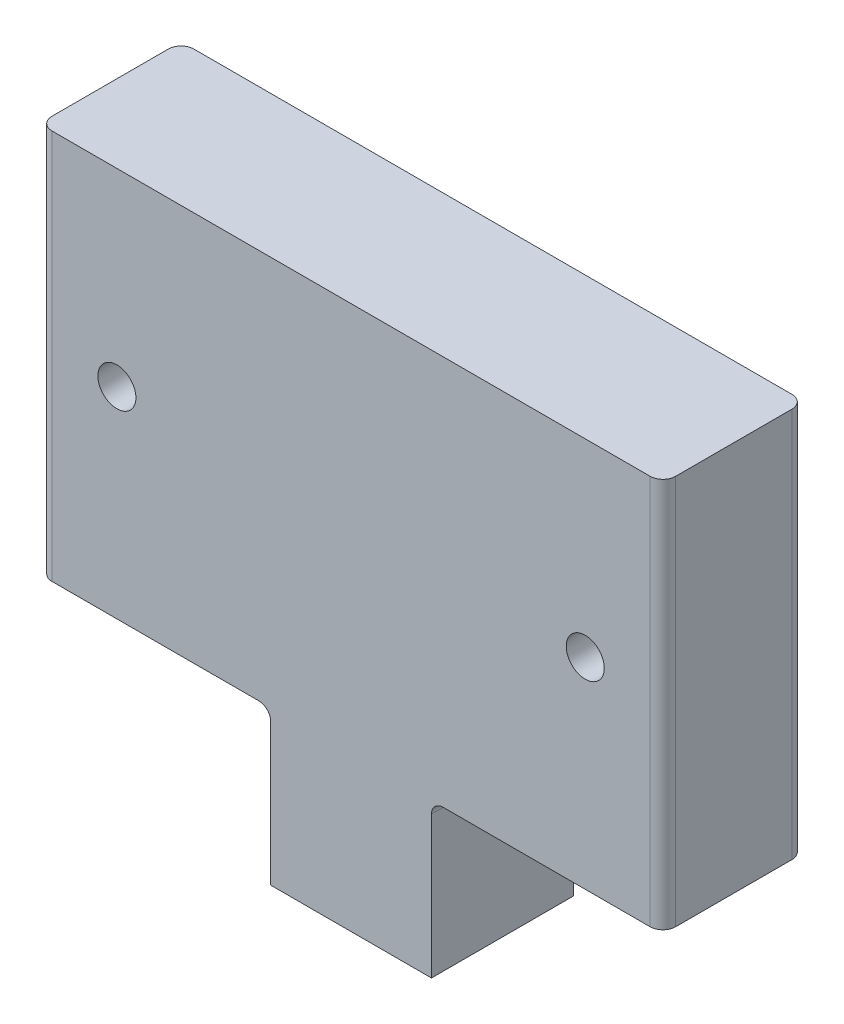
ISO-10303-21;
HEADER;
FILE_DESCRIPTION(('STEP AP214'),'2;1');
FILE_NAME('part.step','',(''),(''),'','','');
FILE_SCHEMA(('AUTOMOTIVE_DESIGN { 1 0 10303 214 1 1 1 1 }'));
ENDSEC;
DATA;
#1=APPLICATION_CONTEXT('core data for automotive mechanical design processes');
#2=APPLICATION_PROTOCOL_DEFINITION('international standard','automotive_design',2000,#1);
#3=PRODUCT_CONTEXT('',#1,'mechanical');
#4=PRODUCT('Part','Part','',(#3));
#5=PRODUCT_RELATED_PRODUCT_CATEGORY('part','',(#4));
#6=PRODUCT_DEFINITION_FORMATION('','',#4);
#7=PRODUCT_DEFINITION_CONTEXT('part definition',#1,'design');
#8=PRODUCT_DEFINITION('design','',#6,#7);
#9=PRODUCT_DEFINITION_SHAPE('','',#8);
#10=(LENGTH_UNIT() NAMED_UNIT(*) SI_UNIT(.MILLI.,.METRE.));
#11=(NAMED_UNIT(*) PLANE_ANGLE_UNIT() SI_UNIT($,.RADIAN.));
#12=(NAMED_UNIT(*) SI_UNIT($,.STERADIAN.) SOLID_ANGLE_UNIT());
#13=UNCERTAINTY_MEASURE_WITH_UNIT(LENGTH_MEASURE(1.E-05),#10,'distance_accuracy_value','');
#14=(GEOMETRIC_REPRESENTATION_CONTEXT(3) GLOBAL_UNCERTAINTY_ASSIGNED_CONTEXT((#13)) GLOBAL_UNIT_ASSIGNED_CONTEXT((#10,
#11,#12)) REPRESENTATION_CONTEXT('',''));
#15=CARTESIAN_POINT('',(0.,0.,0.));
#16=DIRECTION('',(0.,0.,1.));
#17=DIRECTION('',(1.,0.,0.));
#18=AXIS2_PLACEMENT_3D('',#15,#16,#17);
#19=CARTESIAN_POINT('',(-41.8718999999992,-26.19375,9.525));
#20=DIRECTION('',(0.,1.,0.));
#21=DIRECTION('',(0.,0.,1.));
#22=AXIS2_PLACEMENT_3D('',#19,#20,#21);
#23=PLANE('',#22);
#24=DIRECTION('',(1.,0.,0.));
#25=VECTOR('',#24,1.);
#26=CARTESIAN_POINT('',(-41.8718999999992,-26.19375,9.525));
#27=LINE('',#26,#25);
#28=CARTESIAN_POINT('',(12.3824999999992,-26.19375,9.525));
#29=VERTEX_POINT('',#28);
#30=CARTESIAN_POINT('',(40.1573999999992,-26.19375,9.525));
#31=VERTEX_POINT('',#30);
#32=EDGE_CURVE('E183',#29,#31,#27,.T.);
#33=ORIENTED_EDGE('',*,*,#32,.F.);
#34=DIRECTION('',(0.,0.,1.));
#35=VECTOR('',#34,1.);
#36=CARTESIAN_POINT('',(12.3824999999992,-26.19375,9.525));
#37=LINE('',#36,#35);
#38=CARTESIAN_POINT('',(12.3824999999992,-26.19375,-9.525));
#39=VERTEX_POINT('',#38);
#40=EDGE_CURVE('E58',#29,#39,#37,.F.);
#41=ORIENTED_EDGE('',*,*,#40,.T.);
#42=DIRECTION('',(1.,0.,0.));
#43=VECTOR('',#42,1.);
#44=CARTESIAN_POINT('',(-41.8718999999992,-26.19375,-9.525));
#45=LINE('',#44,#43);
#46=CARTESIAN_POINT('',(40.1573999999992,-26.19375,-9.525));
#47=VERTEX_POINT('',#46);
#48=EDGE_CURVE('E190',#39,#47,#45,.T.);
#49=ORIENTED_EDGE('',*,*,#48,.T.);
#50=CARTESIAN_POINT('',(40.1573999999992,-26.19375,-7.8105));
#51=DIRECTION('',(0.,1.,0.));
#52=DIRECTION('',(0.,0.,1.));
#53=AXIS2_PLACEMENT_3D('',#50,#51,#52);
#54=CIRCLE('',#53,1.7145);
#55=CARTESIAN_POINT('',(41.8718999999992,-26.19375,-7.81049999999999));
#56=VERTEX_POINT('',#55);
#57=EDGE_CURVE('E240',#47,#56,#54,.F.);
#58=ORIENTED_EDGE('',*,*,#57,.T.);
#59=DIRECTION('',(0.,0.,-1.));
#60=VECTOR('',#59,1.);
#61=CARTESIAN_POINT('',(41.8718999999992,-26.19375,9.525));
#62=LINE('',#61,#60);
#63=CARTESIAN_POINT('',(41.8718999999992,-26.19375,7.8105));
#64=VERTEX_POINT('',#63);
#65=EDGE_CURVE('E187',#64,#56,#62,.T.);
#66=ORIENTED_EDGE('',*,*,#65,.F.);
#67=CARTESIAN_POINT('',(40.1573999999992,-26.19375,7.8105));
#68=DIRECTION('',(0.,1.,0.));
#69=DIRECTION('',(0.,0.,1.));
#70=AXIS2_PLACEMENT_3D('',#67,#68,#69);
#71=CIRCLE('',#70,1.7145);
#72=EDGE_CURVE('E237',#64,#31,#71,.F.);
#73=ORIENTED_EDGE('',*,*,#72,.T.);
#74=EDGE_LOOP('',(#33,#41,#49,#58,#66,#73));
#75=FACE_BOUND('',#74,.T.);
#76=ADVANCED_FACE('F37',(#75),#23,.F.);
#77=CARTESIAN_POINT('',(41.8718999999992,26.19375,9.525));
#78=DIRECTION('',(-1.,0.,0.));
#79=DIRECTION('',(0.,0.,1.));
#80=AXIS2_PLACEMENT_3D('',#77,#78,#79);
#81=PLANE('',#80);
#82=ORIENTED_EDGE('',*,*,#65,.T.);
#83=DIRECTION('',(0.,1.,0.));
#84=VECTOR('',#83,1.);
#85=CARTESIAN_POINT('',(41.8718999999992,26.19375,-7.8105));
#86=LINE('',#85,#84);
#87=CARTESIAN_POINT('',(41.8718999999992,26.19375,-7.81049999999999));
#88=VERTEX_POINT('',#87);
#89=EDGE_CURVE('E234',#56,#88,#86,.T.);
#90=ORIENTED_EDGE('',*,*,#89,.T.);
#91=DIRECTION('',(0.,0.,-1.));
#92=VECTOR('',#91,1.);
#93=CARTESIAN_POINT('',(41.8718999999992,26.19375,9.525));
#94=LINE('',#93,#92);
#95=CARTESIAN_POINT('',(41.8718999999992,26.19375,7.8105));
#96=VERTEX_POINT('',#95);
#97=EDGE_CURVE('E201',#96,#88,#94,.T.);
#98=ORIENTED_EDGE('',*,*,#97,.F.);
#99=DIRECTION('',(0.,1.,0.));
#100=VECTOR('',#99,1.);
#101=CARTESIAN_POINT('',(41.8718999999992,-26.19375,7.8105));
#102=LINE('',#101,#100);
#103=EDGE_CURVE('E232',#96,#64,#102,.F.);
#104=ORIENTED_EDGE('',*,*,#103,.T.);
#105=EDGE_LOOP('',(#82,#90,#98,#104));
#106=FACE_BOUND('',#105,.T.);
#107=ADVANCED_FACE('F275',(#106),#81,.F.);
#108=CARTESIAN_POINT('',(-41.8718999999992,26.19375,9.525));
#109=DIRECTION('',(0.,-1.,0.));
#110=DIRECTION('',(0.,0.,-1.));
#111=AXIS2_PLACEMENT_3D('',#108,#109,#110);
#112=PLANE('',#111);
#113=DIRECTION('',(-1.,0.,0.));
#114=VECTOR('',#113,1.);
#115=CARTESIAN_POINT('',(-41.8718999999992,26.19375,-9.525));
#116=LINE('',#115,#114);
#117=CARTESIAN_POINT('',(40.1573999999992,26.19375,-9.525));
#118=VERTEX_POINT('',#117);
#119=CARTESIAN_POINT('',(-40.1573999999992,26.19375,-9.525));
#120=VERTEX_POINT('',#119);
#121=EDGE_CURVE('E180',#118,#120,#116,.T.);
#122=ORIENTED_EDGE('',*,*,#121,.T.);
#123=CARTESIAN_POINT('',(-40.1573999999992,26.19375,-7.8105));
#124=DIRECTION('',(0.,-1.,0.));
#125=DIRECTION('',(0.,0.,-1.));
#126=AXIS2_PLACEMENT_3D('',#123,#124,#125);
#127=CIRCLE('',#126,1.7145);
#128=CARTESIAN_POINT('',(-41.8718999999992,26.19375,-7.81049999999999));
#129=VERTEX_POINT('',#128);
#130=EDGE_CURVE('E224',#120,#129,#127,.F.);
#131=ORIENTED_EDGE('',*,*,#130,.T.);
#132=DIRECTION('',(0.,0.,-1.));
#133=VECTOR('',#132,1.);
#134=CARTESIAN_POINT('',(-41.8718999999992,26.19375,9.525));
#135=LINE('',#134,#133);
#136=CARTESIAN_POINT('',(-41.8718999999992,26.19375,7.8105));
#137=VERTEX_POINT('',#136);
#138=EDGE_CURVE('E198',#137,#129,#135,.T.);
#139=ORIENTED_EDGE('',*,*,#138,.F.);
#140=CARTESIAN_POINT('',(-40.1573999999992,26.19375,7.8105));
#141=DIRECTION('',(0.,-1.,0.));
#142=DIRECTION('',(0.,0.,-1.));
#143=AXIS2_PLACEMENT_3D('',#140,#141,#142);
#144=CIRCLE('',#143,1.7145);
#145=CARTESIAN_POINT('',(-40.1573999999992,26.19375,9.525));
#146=VERTEX_POINT('',#145);
#147=EDGE_CURVE('E222',#137,#146,#144,.F.);
#148=ORIENTED_EDGE('',*,*,#147,.T.);
#149=DIRECTION('',(-1.,0.,0.));
#150=VECTOR('',#149,1.);
#151=CARTESIAN_POINT('',(-41.8718999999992,26.19375,9.525));
#152=LINE('',#151,#150);
#153=CARTESIAN_POINT('',(40.1573999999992,26.19375,9.525));
#154=VERTEX_POINT('',#153);
#155=EDGE_CURVE('E181',#154,#146,#152,.T.);
#156=ORIENTED_EDGE('',*,*,#155,.F.);
#157=CARTESIAN_POINT('',(40.1573999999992,26.19375,7.8105));
#158=DIRECTION('',(0.,-1.,0.));
#159=DIRECTION('',(0.,0.,-1.));
#160=AXIS2_PLACEMENT_3D('',#157,#158,#159);
#161=CIRCLE('',#160,1.7145);
#162=EDGE_CURVE('E218',#154,#96,#161,.F.);
#163=ORIENTED_EDGE('',*,*,#162,.T.);
#164=ORIENTED_EDGE('',*,*,#97,.T.);
#165=CARTESIAN_POINT('',(40.1573999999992,26.19375,-7.8105));
#166=DIRECTION('',(0.,-1.,0.));
#167=DIRECTION('',(0.,0.,-1.));
#168=AXIS2_PLACEMENT_3D('',#165,#166,#167);
#169=CIRCLE('',#168,1.7145);
#170=EDGE_CURVE('E220',#88,#118,#169,.F.);
#171=ORIENTED_EDGE('',*,*,#170,.T.);
#172=EDGE_LOOP('',(#122,#131,#139,#148,#156,#163,#164,#171));
#173=FACE_BOUND('',#172,.T.);
#174=ADVANCED_FACE('F280',(#173),#112,.F.);
#175=CARTESIAN_POINT('',(-41.8718999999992,26.19375,9.525));
#176=DIRECTION('',(1.,0.,0.));
#177=DIRECTION('',(0.,0.,-1.));
#178=AXIS2_PLACEMENT_3D('',#175,#176,#177);
#179=PLANE('',#178);
#180=ORIENTED_EDGE('',*,*,#138,.T.);
#181=DIRECTION('',(0.,-1.,0.));
#182=VECTOR('',#181,1.);
#183=CARTESIAN_POINT('',(-41.8718999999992,26.19375,-7.8105));
#184=LINE('',#183,#182);
#185=CARTESIAN_POINT('',(-41.8718999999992,-26.19375,-7.81049999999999));
#186=VERTEX_POINT('',#185);
#187=EDGE_CURVE('E206',#129,#186,#184,.T.);
#188=ORIENTED_EDGE('',*,*,#187,.T.);
#189=DIRECTION('',(0.,0.,-1.));
#190=VECTOR('',#189,1.);
#191=CARTESIAN_POINT('',(-41.8718999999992,-26.19375,9.525));
#192=LINE('',#191,#190);
#193=CARTESIAN_POINT('',(-41.8718999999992,-26.19375,7.8105));
#194=VERTEX_POINT('',#193);
#195=EDGE_CURVE('E195',#194,#186,#192,.T.);
#196=ORIENTED_EDGE('',*,*,#195,.F.);
#197=DIRECTION('',(0.,-1.,0.));
#198=VECTOR('',#197,1.);
#199=CARTESIAN_POINT('',(-41.8718999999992,26.19375,7.8105));
#200=LINE('',#199,#198);
#201=EDGE_CURVE('E204',#194,#137,#200,.F.);
#202=ORIENTED_EDGE('',*,*,#201,.T.);
#203=EDGE_LOOP('',(#180,#188,#196,#202));
#204=FACE_BOUND('',#203,.T.);
#205=ADVANCED_FACE('F286',(#204),#179,.F.);
#206=CARTESIAN_POINT('',(-40.1573999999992,-26.19375,-9.525));
#207=VERTEX_POINT('',#206);
#208=CARTESIAN_POINT('',(-12.3824999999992,-26.19375,-9.525));
#209=VERTEX_POINT('',#208);
#210=EDGE_CURVE('E184',#207,#209,#45,.T.);
#211=ORIENTED_EDGE('',*,*,#210,.T.);
#212=DIRECTION('',(0.,0.,1.));
#213=VECTOR('',#212,1.);
#214=CARTESIAN_POINT('',(-12.3824999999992,-26.19375,9.525));
#215=LINE('',#214,#213);
#216=CARTESIAN_POINT('',(-12.3824999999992,-26.19375,9.525));
#217=VERTEX_POINT('',#216);
#218=EDGE_CURVE('E242',#209,#217,#215,.T.);
#219=ORIENTED_EDGE('',*,*,#218,.T.);
#220=CARTESIAN_POINT('',(-40.1573999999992,-26.19375,9.525));
#221=VERTEX_POINT('',#220);
#222=EDGE_CURVE('E185',#221,#217,#27,.T.);
#223=ORIENTED_EDGE('',*,*,#222,.F.);
#224=CARTESIAN_POINT('',(-40.1573999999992,-26.19375,7.8105));
#225=DIRECTION('',(0.,1.,0.));
#226=DIRECTION('',(0.,0.,1.));
#227=AXIS2_PLACEMENT_3D('',#224,#225,#226);
#228=CIRCLE('',#227,1.7145);
#229=EDGE_CURVE('E209',#221,#194,#228,.F.);
#230=ORIENTED_EDGE('',*,*,#229,.T.);
#231=ORIENTED_EDGE('',*,*,#195,.T.);
#232=CARTESIAN_POINT('',(-40.1573999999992,-26.19375,-7.8105));
#233=DIRECTION('',(0.,1.,0.));
#234=DIRECTION('',(0.,0.,1.));
#235=AXIS2_PLACEMENT_3D('',#232,#233,#234);
#236=CIRCLE('',#235,1.7145);
#237=EDGE_CURVE('E211',#186,#207,#236,.F.);
#238=ORIENTED_EDGE('',*,*,#237,.T.);
#239=EDGE_LOOP('',(#211,#219,#223,#230,#231,#238));
#240=FACE_BOUND('',#239,.T.);
#241=ADVANCED_FACE('F261',(#240),#23,.F.);
#242=CARTESIAN_POINT('',(0.,0.,9.525));
#243=DIRECTION('',(0.,0.,1.));
#244=DIRECTION('',(1.,0.,0.));
#245=AXIS2_PLACEMENT_3D('',#242,#243,#244);
#246=PLANE('',#245);
#247=CARTESIAN_POINT('',(-31.4451999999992,0.79374999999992,9.525));
#248=DIRECTION('',(0.,0.,1.));
#249=DIRECTION('',(1.,0.,0.));
#250=AXIS2_PLACEMENT_3D('',#247,#248,#249);
#251=CIRCLE('',#250,2.5527);
#252=CARTESIAN_POINT('',(-28.8924999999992,0.79374999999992,9.525));
#253=VERTEX_POINT('',#252);
#254=EDGE_CURVE('E168',#253,#253,#251,.T.);
#255=ORIENTED_EDGE('',*,*,#254,.F.);
#256=EDGE_LOOP('',(#255));
#257=FACE_BOUND('',#256,.T.);
#258=CARTESIAN_POINT('',(31.4451999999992,0.79374999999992,9.525));
#259=DIRECTION('',(0.,0.,1.));
#260=DIRECTION('',(1.,0.,0.));
#261=AXIS2_PLACEMENT_3D('',#258,#259,#260);
#262=CIRCLE('',#261,2.5527);
#263=CARTESIAN_POINT('',(33.9978999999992,0.79374999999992,9.525));
#264=VERTEX_POINT('',#263);
#265=EDGE_CURVE('E174',#264,#264,#262,.T.);
#266=ORIENTED_EDGE('',*,*,#265,.F.);
#267=EDGE_LOOP('',(#266));
#268=FACE_BOUND('',#267,.T.);
#269=ORIENTED_EDGE('',*,*,#155,.T.);
#270=DIRECTION('',(0.,-1.,0.));
#271=VECTOR('',#270,1.);
#272=CARTESIAN_POINT('',(-40.1573999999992,-26.19375,9.525));
#273=LINE('',#272,#271);
#274=EDGE_CURVE('E229',#146,#221,#273,.T.);
#275=ORIENTED_EDGE('',*,*,#274,.T.);
#276=ORIENTED_EDGE('',*,*,#222,.T.);
#277=CARTESIAN_POINT('',(-12.3824999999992,-27.78125,9.525));
#278=DIRECTION('',(0.,0.,1.));
#279=DIRECTION('',(1.,0.,0.));
#280=AXIS2_PLACEMENT_3D('',#277,#278,#279);
#281=CIRCLE('',#280,1.5875);
#282=CARTESIAN_POINT('',(-10.7949999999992,-27.78125,9.525));
#283=VERTEX_POINT('',#282);
#284=EDGE_CURVE('E142',#217,#283,#281,.F.);
#285=ORIENTED_EDGE('',*,*,#284,.T.);
#286=DIRECTION('',(0.,-1.,0.));
#287=VECTOR('',#286,1.);
#288=CARTESIAN_POINT('',(-10.7949999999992,-26.19375,9.525));
#289=LINE('',#288,#287);
#290=CARTESIAN_POINT('',(-10.7949999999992,-46.83125,9.525));
#291=VERTEX_POINT('',#290);
#292=EDGE_CURVE('E135',#283,#291,#289,.T.);
#293=ORIENTED_EDGE('',*,*,#292,.T.);
#294=DIRECTION('',(1.,0.,0.));
#295=VECTOR('',#294,1.);
#296=CARTESIAN_POINT('',(-10.7949999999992,-46.83125,9.525));
#297=LINE('',#296,#295);
#298=CARTESIAN_POINT('',(10.7949999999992,-46.83125,9.525));
#299=VERTEX_POINT('',#298);
#300=EDGE_CURVE('E140',#291,#299,#297,.T.);
#301=ORIENTED_EDGE('',*,*,#300,.T.);
#302=DIRECTION('',(0.,1.,0.));
#303=VECTOR('',#302,1.);
#304=CARTESIAN_POINT('',(10.7949999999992,-26.19375,9.525));
#305=LINE('',#304,#303);
#306=CARTESIAN_POINT('',(10.7949999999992,-27.78125,9.525));
#307=VERTEX_POINT('',#306);
#308=EDGE_CURVE('E155',#299,#307,#305,.T.);
#309=ORIENTED_EDGE('',*,*,#308,.T.);
#310=CARTESIAN_POINT('',(12.3824999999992,-27.78125,9.525));
#311=DIRECTION('',(0.,0.,1.));
#312=DIRECTION('',(1.,0.,0.));
#313=AXIS2_PLACEMENT_3D('',#310,#311,#312);
#314=CIRCLE('',#313,1.5875);
#315=EDGE_CURVE('E45',#307,#29,#314,.F.);
#316=ORIENTED_EDGE('',*,*,#315,.T.);
#317=ORIENTED_EDGE('',*,*,#32,.T.);
#318=DIRECTION('',(0.,1.,0.));
#319=VECTOR('',#318,1.);
#320=CARTESIAN_POINT('',(40.1573999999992,26.19375,9.525));
#321=LINE('',#320,#319);
#322=EDGE_CURVE('E226',#31,#154,#321,.T.);
#323=ORIENTED_EDGE('',*,*,#322,.T.);
#324=EDGE_LOOP('',(#269,#275,#276,#285,#293,#301,#309,#316,#317,#323));
#325=FACE_BOUND('',#324,.T.);
#326=ADVANCED_FACE('F138',(#257,#268,#325),#246,.T.);
#327=CARTESIAN_POINT('',(0.,0.,-9.525));
#328=DIRECTION('',(0.,0.,1.));
#329=DIRECTION('',(1.,0.,0.));
#330=AXIS2_PLACEMENT_3D('',#327,#328,#329);
#331=PLANE('',#330);
#332=CARTESIAN_POINT('',(-31.4451999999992,0.79374999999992,-9.525));
#333=DIRECTION('',(0.,0.,1.));
#334=DIRECTION('',(1.,0.,0.));
#335=AXIS2_PLACEMENT_3D('',#332,#333,#334);
#336=CIRCLE('',#335,2.5527);
#337=CARTESIAN_POINT('',(-28.8924999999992,0.79374999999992,-9.525));
#338=VERTEX_POINT('',#337);
#339=EDGE_CURVE('E171',#338,#338,#336,.T.);
#340=ORIENTED_EDGE('',*,*,#339,.T.);
#341=EDGE_LOOP('',(#340));
#342=FACE_BOUND('',#341,.T.);
#343=CARTESIAN_POINT('',(31.4451999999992,0.79374999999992,-9.525));
#344=DIRECTION('',(0.,0.,1.));
#345=DIRECTION('',(1.,0.,0.));
#346=AXIS2_PLACEMENT_3D('',#343,#344,#345);
#347=CIRCLE('',#346,2.5527);
#348=CARTESIAN_POINT('',(33.9978999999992,0.79374999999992,-9.525));
#349=VERTEX_POINT('',#348);
#350=EDGE_CURVE('E177',#349,#349,#347,.T.);
#351=ORIENTED_EDGE('',*,*,#350,.T.);
#352=EDGE_LOOP('',(#351));
#353=FACE_BOUND('',#352,.T.);
#354=ORIENTED_EDGE('',*,*,#210,.F.);
#355=DIRECTION('',(0.,-1.,0.));
#356=VECTOR('',#355,1.);
#357=CARTESIAN_POINT('',(-40.1573999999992,0.,-9.525));
#358=LINE('',#357,#356);
#359=EDGE_CURVE('E216',#207,#120,#358,.F.);
#360=ORIENTED_EDGE('',*,*,#359,.T.);
#361=ORIENTED_EDGE('',*,*,#121,.F.);
#362=DIRECTION('',(0.,1.,0.));
#363=VECTOR('',#362,1.);
#364=CARTESIAN_POINT('',(40.1573999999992,0.,-9.525));
#365=LINE('',#364,#363);
#366=EDGE_CURVE('E213',#118,#47,#365,.F.);
#367=ORIENTED_EDGE('',*,*,#366,.T.);
#368=ORIENTED_EDGE('',*,*,#48,.F.);
#369=CARTESIAN_POINT('',(12.3824999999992,-27.78125,-9.525));
#370=DIRECTION('',(0.,0.,1.));
#371=DIRECTION('',(1.,0.,0.));
#372=AXIS2_PLACEMENT_3D('',#369,#370,#371);
#373=CIRCLE('',#372,1.5875);
#374=CARTESIAN_POINT('',(10.7949999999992,-27.78125,-9.525));
#375=VERTEX_POINT('',#374);
#376=EDGE_CURVE('E11',#39,#375,#373,.T.);
#377=ORIENTED_EDGE('',*,*,#376,.T.);
#378=DIRECTION('',(0.,-1.,0.));
#379=VECTOR('',#378,1.);
#380=CARTESIAN_POINT('',(10.7949999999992,-26.19375,-9.525));
#381=LINE('',#380,#379);
#382=CARTESIAN_POINT('',(10.7949999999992,-46.83125,-9.525));
#383=VERTEX_POINT('',#382);
#384=EDGE_CURVE('E164',#375,#383,#381,.T.);
#385=ORIENTED_EDGE('',*,*,#384,.T.);
#386=DIRECTION('',(-1.,0.,0.));
#387=VECTOR('',#386,1.);
#388=CARTESIAN_POINT('',(-10.7949999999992,-46.83125,-9.525));
#389=LINE('',#388,#387);
#390=CARTESIAN_POINT('',(-10.7949999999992,-46.83125,-9.525));
#391=VERTEX_POINT('',#390);
#392=EDGE_CURVE('E166',#383,#391,#389,.T.);
#393=ORIENTED_EDGE('',*,*,#392,.T.);
#394=DIRECTION('',(0.,1.,0.));
#395=VECTOR('',#394,1.);
#396=CARTESIAN_POINT('',(-10.7949999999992,-26.19375,-9.525));
#397=LINE('',#396,#395);
#398=CARTESIAN_POINT('',(-10.7949999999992,-27.78125,-9.525));
#399=VERTEX_POINT('',#398);
#400=EDGE_CURVE('E151',#391,#399,#397,.T.);
#401=ORIENTED_EDGE('',*,*,#400,.T.);
#402=CARTESIAN_POINT('',(-12.3824999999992,-27.78125,-9.525));
#403=DIRECTION('',(0.,0.,1.));
#404=DIRECTION('',(1.,0.,0.));
#405=AXIS2_PLACEMENT_3D('',#402,#403,#404);
#406=CIRCLE('',#405,1.5875);
#407=EDGE_CURVE('E252',#399,#209,#406,.T.);
#408=ORIENTED_EDGE('',*,*,#407,.T.);
#409=EDGE_LOOP('',(#354,#360,#361,#367,#368,#377,#385,#393,#401,#408));
#410=FACE_BOUND('',#409,.T.);
#411=ADVANCED_FACE('F256',(#342,#353,#410),#331,.F.);
#412=CARTESIAN_POINT('',(31.4451999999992,0.79374999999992,9.525));
#413=DIRECTION('',(0.,0.,1.));
#414=DIRECTION('',(1.,0.,0.));
#415=AXIS2_PLACEMENT_3D('',#412,#413,#414);
#416=CYLINDRICAL_SURFACE('',#415,2.5527);
#417=ORIENTED_EDGE('',*,*,#350,.F.);
#418=EDGE_LOOP('',(#417));
#419=FACE_BOUND('',#418,.T.);
#420=ORIENTED_EDGE('',*,*,#265,.T.);
#421=EDGE_LOOP('',(#420));
#422=FACE_BOUND('',#421,.T.);
#423=ADVANCED_FACE('F338',(#419,#422),#416,.F.);
#424=CARTESIAN_POINT('',(-31.4451999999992,0.79374999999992,9.525));
#425=DIRECTION('',(0.,0.,1.));
#426=DIRECTION('',(1.,0.,0.));
#427=AXIS2_PLACEMENT_3D('',#424,#425,#426);
#428=CYLINDRICAL_SURFACE('',#427,2.5527);
#429=ORIENTED_EDGE('',*,*,#339,.F.);
#430=EDGE_LOOP('',(#429));
#431=FACE_BOUND('',#430,.T.);
#432=ORIENTED_EDGE('',*,*,#254,.T.);
#433=EDGE_LOOP('',(#432));
#434=FACE_BOUND('',#433,.T.);
#435=ADVANCED_FACE('F333',(#431,#434),#428,.F.);
#436=CARTESIAN_POINT('',(-10.7949999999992,-26.19375,-39.391946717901));
#437=DIRECTION('',(-1.,0.,0.));
#438=DIRECTION('',(0.,0.,1.));
#439=AXIS2_PLACEMENT_3D('',#436,#437,#438);
#440=PLANE('',#439);
#441=ORIENTED_EDGE('',*,*,#292,.F.);
#442=DIRECTION('',(0.,0.,1.));
#443=VECTOR('',#442,1.);
#444=CARTESIAN_POINT('',(-10.7949999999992,-27.78125,-39.391946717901));
#445=LINE('',#444,#443);
#446=EDGE_CURVE('E245',#283,#399,#445,.F.);
#447=ORIENTED_EDGE('',*,*,#446,.T.);
#448=ORIENTED_EDGE('',*,*,#400,.F.);
#449=DIRECTION('',(0.,0.,1.));
#450=VECTOR('',#449,1.);
#451=CARTESIAN_POINT('',(-10.7949999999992,-46.83125,-39.391946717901));
#452=LINE('',#451,#450);
#453=EDGE_CURVE('E148',#391,#291,#452,.T.);
#454=ORIENTED_EDGE('',*,*,#453,.T.);
#455=EDGE_LOOP('',(#441,#447,#448,#454));
#456=FACE_BOUND('',#455,.T.);
#457=ADVANCED_FACE('F149',(#456),#440,.T.);
#458=CARTESIAN_POINT('',(10.7949999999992,-26.19375,-39.391946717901));
#459=DIRECTION('',(1.,0.,0.));
#460=DIRECTION('',(0.,0.,-1.));
#461=AXIS2_PLACEMENT_3D('',#458,#459,#460);
#462=PLANE('',#461);
#463=ORIENTED_EDGE('',*,*,#384,.F.);
#464=DIRECTION('',(0.,0.,1.));
#465=VECTOR('',#464,1.);
#466=CARTESIAN_POINT('',(10.7949999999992,-27.78125,-39.391946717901));
#467=LINE('',#466,#465);
#468=EDGE_CURVE('E247',#375,#307,#467,.T.);
#469=ORIENTED_EDGE('',*,*,#468,.T.);
#470=ORIENTED_EDGE('',*,*,#308,.F.);
#471=DIRECTION('',(0.,0.,1.));
#472=VECTOR('',#471,1.);
#473=CARTESIAN_POINT('',(10.7949999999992,-46.83125,-39.391946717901));
#474=LINE('',#473,#472);
#475=EDGE_CURVE('E154',#383,#299,#474,.T.);
#476=ORIENTED_EDGE('',*,*,#475,.F.);
#477=EDGE_LOOP('',(#463,#469,#470,#476));
#478=FACE_BOUND('',#477,.T.);
#479=ADVANCED_FACE('F324',(#478),#462,.T.);
#480=CARTESIAN_POINT('',(-10.7949999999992,-46.83125,-39.391946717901));
#481=DIRECTION('',(0.,-1.,0.));
#482=DIRECTION('',(0.,0.,-1.));
#483=AXIS2_PLACEMENT_3D('',#480,#481,#482);
#484=PLANE('',#483);
#485=ORIENTED_EDGE('',*,*,#392,.F.);
#486=ORIENTED_EDGE('',*,*,#475,.T.);
#487=ORIENTED_EDGE('',*,*,#300,.F.);
#488=ORIENTED_EDGE('',*,*,#453,.F.);
#489=EDGE_LOOP('',(#485,#486,#487,#488));
#490=FACE_BOUND('',#489,.T.);
#491=ADVANCED_FACE('F157',(#490),#484,.T.);
#492=CARTESIAN_POINT('',(-40.1573999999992,26.19375,-7.8105));
#493=DIRECTION('',(0.,-1.,0.));
#494=DIRECTION('',(0.,0.,-1.));
#495=AXIS2_PLACEMENT_3D('',#492,#493,#494);
#496=CYLINDRICAL_SURFACE('',#495,1.7145);
#497=ORIENTED_EDGE('',*,*,#130,.F.);
#498=ORIENTED_EDGE('',*,*,#359,.F.);
#499=ORIENTED_EDGE('',*,*,#237,.F.);
#500=ORIENTED_EDGE('',*,*,#187,.F.);
#501=EDGE_LOOP('',(#497,#498,#499,#500));
#502=FACE_BOUND('',#501,.T.);
#503=ADVANCED_FACE('F300',(#502),#496,.T.);
#504=CARTESIAN_POINT('',(-40.1573999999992,0.,7.8105));
#505=DIRECTION('',(0.,1.,0.));
#506=DIRECTION('',(0.,0.,1.));
#507=AXIS2_PLACEMENT_3D('',#504,#505,#506);
#508=CYLINDRICAL_SURFACE('',#507,1.7145);
#509=ORIENTED_EDGE('',*,*,#147,.F.);
#510=ORIENTED_EDGE('',*,*,#201,.F.);
#511=ORIENTED_EDGE('',*,*,#229,.F.);
#512=ORIENTED_EDGE('',*,*,#274,.F.);
#513=EDGE_LOOP('',(#509,#510,#511,#512));
#514=FACE_BOUND('',#513,.T.);
#515=ADVANCED_FACE('F303',(#514),#508,.T.);
#516=CARTESIAN_POINT('',(40.1573999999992,26.19375,-7.8105));
#517=DIRECTION('',(0.,1.,0.));
#518=DIRECTION('',(0.,0.,1.));
#519=AXIS2_PLACEMENT_3D('',#516,#517,#518);
#520=CYLINDRICAL_SURFACE('',#519,1.7145);
#521=ORIENTED_EDGE('',*,*,#57,.F.);
#522=ORIENTED_EDGE('',*,*,#366,.F.);
#523=ORIENTED_EDGE('',*,*,#170,.F.);
#524=ORIENTED_EDGE('',*,*,#89,.F.);
#525=EDGE_LOOP('',(#521,#522,#523,#524));
#526=FACE_BOUND('',#525,.T.);
#527=ADVANCED_FACE('F271',(#526),#520,.T.);
#528=CARTESIAN_POINT('',(40.1573999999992,0.,7.8105));
#529=DIRECTION('',(0.,-1.,0.));
#530=DIRECTION('',(0.,0.,-1.));
#531=AXIS2_PLACEMENT_3D('',#528,#529,#530);
#532=CYLINDRICAL_SURFACE('',#531,1.7145);
#533=ORIENTED_EDGE('',*,*,#72,.F.);
#534=ORIENTED_EDGE('',*,*,#103,.F.);
#535=ORIENTED_EDGE('',*,*,#162,.F.);
#536=ORIENTED_EDGE('',*,*,#322,.F.);
#537=EDGE_LOOP('',(#533,#534,#535,#536));
#538=FACE_BOUND('',#537,.T.);
#539=ADVANCED_FACE('F265',(#538),#532,.T.);
#540=CARTESIAN_POINT('',(-12.3824999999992,-27.78125,9.525));
#541=DIRECTION('',(0.,0.,1.));
#542=DIRECTION('',(1.,0.,0.));
#543=AXIS2_PLACEMENT_3D('',#540,#541,#542);
#544=CYLINDRICAL_SURFACE('',#543,1.5875);
#545=ORIENTED_EDGE('',*,*,#407,.F.);
#546=ORIENTED_EDGE('',*,*,#446,.F.);
#547=ORIENTED_EDGE('',*,*,#284,.F.);
#548=ORIENTED_EDGE('',*,*,#218,.F.);
#549=EDGE_LOOP('',(#545,#546,#547,#548));
#550=FACE_BOUND('',#549,.T.);
#551=ADVANCED_FACE('F263',(#550),#544,.F.);
#552=CARTESIAN_POINT('',(12.3824999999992,-27.78125,-39.391946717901));
#553=DIRECTION('',(0.,0.,1.));
#554=DIRECTION('',(1.,0.,0.));
#555=AXIS2_PLACEMENT_3D('',#552,#553,#554);
#556=CYLINDRICAL_SURFACE('',#555,1.5875);
#557=ORIENTED_EDGE('',*,*,#376,.F.);
#558=ORIENTED_EDGE('',*,*,#40,.F.);
#559=ORIENTED_EDGE('',*,*,#315,.F.);
#560=ORIENTED_EDGE('',*,*,#468,.F.);
#561=EDGE_LOOP('',(#557,#558,#559,#560));
#562=FACE_BOUND('',#561,.T.);
#563=ADVANCED_FACE('F39',(#562),#556,.F.);
#564=CLOSED_SHELL('',(#76,#107,#174,#205,#241,#326,#411,#423,#435,#457,#479,#491,#503,#515,#527,
#539,#551,#563));
#565=MANIFOLD_SOLID_BREP('B2',#564);
#566=ADVANCED_BREP_SHAPE_REPRESENTATION('',(#18,#565),#14);
#567=SHAPE_DEFINITION_REPRESENTATION(#9,#566);
ENDSEC;
END-ISO-10303-21;
